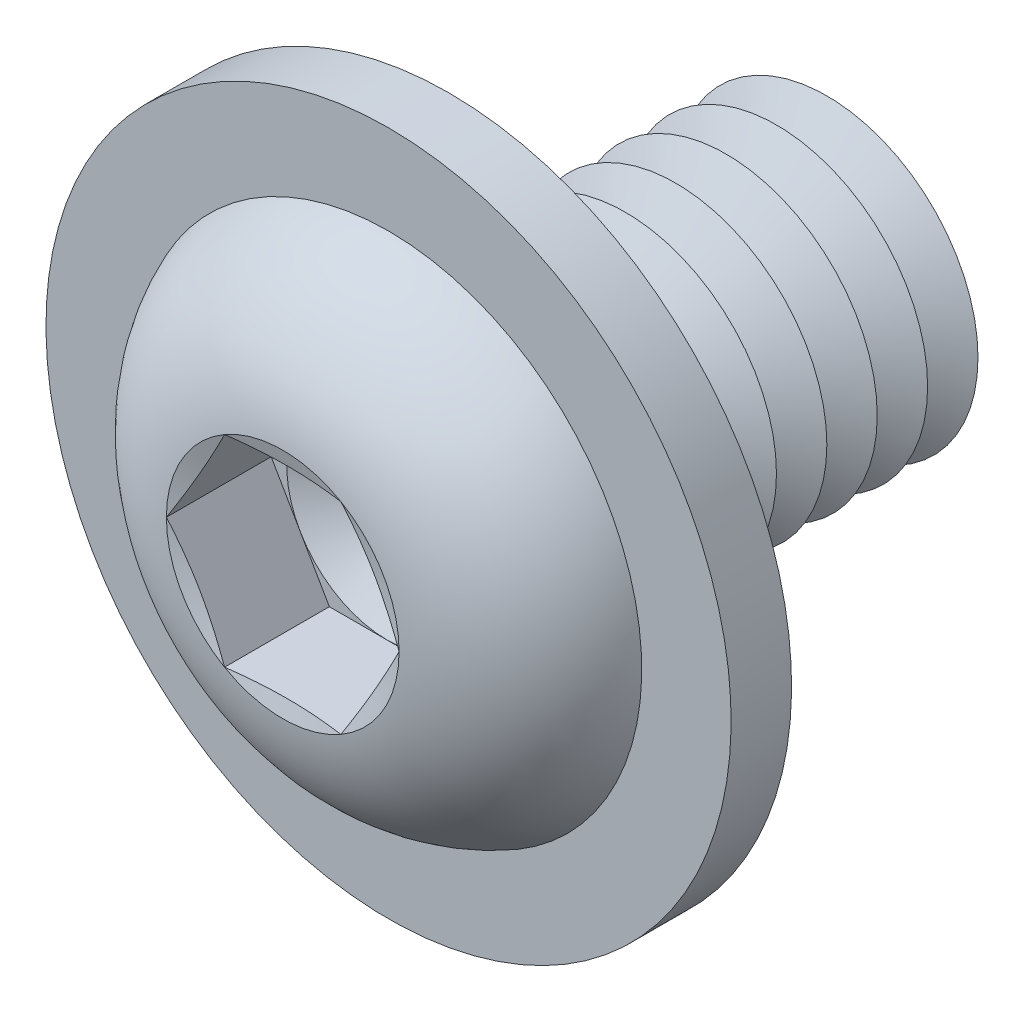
ISO-10303-21;
HEADER;
FILE_DESCRIPTION(('STEP AP214'),'2;1');
FILE_NAME('part.step','',(''),(''),'','','');
FILE_SCHEMA(('AUTOMOTIVE_DESIGN { 1 0 10303 214 1 1 1 1 }'));
ENDSEC;
DATA;
#1=APPLICATION_CONTEXT('core data for automotive mechanical design processes');
#2=APPLICATION_PROTOCOL_DEFINITION('international standard','automotive_design',2000,#1);
#3=PRODUCT_CONTEXT('',#1,'mechanical');
#4=PRODUCT('Part','Part','',(#3));
#5=PRODUCT_RELATED_PRODUCT_CATEGORY('part','',(#4));
#6=PRODUCT_DEFINITION_FORMATION('','',#4);
#7=PRODUCT_DEFINITION_CONTEXT('part definition',#1,'design');
#8=PRODUCT_DEFINITION('design','',#6,#7);
#9=PRODUCT_DEFINITION_SHAPE('','',#8);
#10=(LENGTH_UNIT() NAMED_UNIT(*) SI_UNIT(.MILLI.,.METRE.));
#11=(NAMED_UNIT(*) PLANE_ANGLE_UNIT() SI_UNIT($,.RADIAN.));
#12=(NAMED_UNIT(*) SI_UNIT($,.STERADIAN.) SOLID_ANGLE_UNIT());
#13=UNCERTAINTY_MEASURE_WITH_UNIT(LENGTH_MEASURE(1.E-05),#10,'distance_accuracy_value','');
#14=(GEOMETRIC_REPRESENTATION_CONTEXT(3) GLOBAL_UNCERTAINTY_ASSIGNED_CONTEXT((#13)) GLOBAL_UNIT_ASSIGNED_CONTEXT((#10,
#11,#12)) REPRESENTATION_CONTEXT('',''));
#15=CARTESIAN_POINT('',(0.,0.,0.));
#16=DIRECTION('',(0.,0.,1.));
#17=DIRECTION('',(1.,0.,0.));
#18=AXIS2_PLACEMENT_3D('',#15,#16,#17);
#19=CARTESIAN_POINT('',(0.,0.,-4.5));
#20=DIRECTION('',(0.,0.,1.));
#21=DIRECTION('',(1.,0.,0.));
#22=AXIS2_PLACEMENT_3D('',#19,#20,#21);
#23=CONICAL_SURFACE('',#22,3.,1.0471975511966);
#24=CARTESIAN_POINT('',(0.,0.,-5.));
#25=DIRECTION('',(0.,0.,1.));
#26=DIRECTION('',(1.,0.,0.));
#27=AXIS2_PLACEMENT_3D('',#24,#25,#26);
#28=CIRCLE('',#27,2.13397459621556);
#29=CARTESIAN_POINT('',(2.13397459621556,0.,-5.));
#30=VERTEX_POINT('',#29);
#31=EDGE_CURVE('E274',#30,#30,#28,.T.);
#32=ORIENTED_EDGE('',*,*,#31,.T.);
#33=EDGE_LOOP('',(#32));
#34=FACE_BOUND('',#33,.T.);
#35=CARTESIAN_POINT('',(0.,0.,-4.5));
#36=DIRECTION('',(0.,0.,1.));
#37=DIRECTION('',(1.,0.,0.));
#38=AXIS2_PLACEMENT_3D('',#35,#36,#37);
#39=CIRCLE('',#38,3.);
#40=CARTESIAN_POINT('',(3.,0.,-4.5));
#41=VERTEX_POINT('',#40);
#42=EDGE_CURVE('E270',#41,#41,#39,.T.);
#43=ORIENTED_EDGE('',*,*,#42,.F.);
#44=EDGE_LOOP('',(#43));
#45=FACE_BOUND('',#44,.T.);
#46=ADVANCED_FACE('F39',(#34,#45),#23,.T.);
#47=CARTESIAN_POINT('',(0.,0.,-5.));
#48=DIRECTION('',(0.,0.,-1.));
#49=DIRECTION('',(-1.,0.,0.));
#50=AXIS2_PLACEMENT_3D('',#47,#48,#49);
#51=CONICAL_SURFACE('',#50,2.13397459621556,1.0471975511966);
#52=CARTESIAN_POINT('',(0.,0.,-5.5));
#53=DIRECTION('',(0.,0.,1.));
#54=DIRECTION('',(1.,0.,0.));
#55=AXIS2_PLACEMENT_3D('',#52,#53,#54);
#56=CIRCLE('',#55,3.);
#57=CARTESIAN_POINT('',(3.,0.,-5.5));
#58=VERTEX_POINT('',#57);
#59=EDGE_CURVE('E278',#58,#58,#56,.T.);
#60=ORIENTED_EDGE('',*,*,#59,.T.);
#61=EDGE_LOOP('',(#60));
#62=FACE_BOUND('',#61,.T.);
#63=ORIENTED_EDGE('',*,*,#31,.F.);
#64=EDGE_LOOP('',(#63));
#65=FACE_BOUND('',#64,.T.);
#66=ADVANCED_FACE('F391',(#62,#65),#51,.T.);
#67=CARTESIAN_POINT('',(0.,3.00000000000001,-8.));
#68=DIRECTION('',(0.,0.,-1.));
#69=DIRECTION('',(-1.,0.,0.));
#70=AXIS2_PLACEMENT_3D('',#67,#68,#69);
#71=PLANE('',#70);
#72=CARTESIAN_POINT('',(0.,0.,-8.));
#73=DIRECTION('',(0.,0.,1.));
#74=DIRECTION('',(1.,0.,0.));
#75=AXIS2_PLACEMENT_3D('',#72,#73,#74);
#76=CIRCLE('',#75,2.13397459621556);
#77=CARTESIAN_POINT('',(2.13397459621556,0.,-8.));
#78=VERTEX_POINT('',#77);
#79=EDGE_CURVE('E298',#78,#78,#76,.T.);
#80=ORIENTED_EDGE('',*,*,#79,.F.);
#81=EDGE_LOOP('',(#80));
#82=FACE_BOUND('',#81,.T.);
#83=ADVANCED_FACE('F397',(#82),#71,.T.);
#84=CARTESIAN_POINT('',(0.,0.,-7.5));
#85=DIRECTION('',(0.,0.,1.));
#86=DIRECTION('',(1.,0.,0.));
#87=AXIS2_PLACEMENT_3D('',#84,#85,#86);
#88=CONICAL_SURFACE('',#87,3.,1.0471975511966);
#89=ORIENTED_EDGE('',*,*,#79,.T.);
#90=EDGE_LOOP('',(#89));
#91=FACE_BOUND('',#90,.T.);
#92=CARTESIAN_POINT('',(0.,0.,-7.5));
#93=DIRECTION('',(0.,0.,1.));
#94=DIRECTION('',(1.,0.,0.));
#95=AXIS2_PLACEMENT_3D('',#92,#93,#94);
#96=CIRCLE('',#95,3.);
#97=CARTESIAN_POINT('',(3.,0.,-7.5));
#98=VERTEX_POINT('',#97);
#99=EDGE_CURVE('E294',#98,#98,#96,.T.);
#100=ORIENTED_EDGE('',*,*,#99,.F.);
#101=EDGE_LOOP('',(#100));
#102=FACE_BOUND('',#101,.T.);
#103=ADVANCED_FACE('F416',(#91,#102),#88,.T.);
#104=CARTESIAN_POINT('',(0.,0.,-7.));
#105=DIRECTION('',(0.,0.,-1.));
#106=DIRECTION('',(-1.,0.,0.));
#107=AXIS2_PLACEMENT_3D('',#104,#105,#106);
#108=CONICAL_SURFACE('',#107,2.13397459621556,1.0471975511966);
#109=ORIENTED_EDGE('',*,*,#99,.T.);
#110=EDGE_LOOP('',(#109));
#111=FACE_BOUND('',#110,.T.);
#112=CARTESIAN_POINT('',(0.,0.,-7.));
#113=DIRECTION('',(0.,0.,1.));
#114=DIRECTION('',(1.,0.,0.));
#115=AXIS2_PLACEMENT_3D('',#112,#113,#114);
#116=CIRCLE('',#115,2.13397459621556);
#117=CARTESIAN_POINT('',(2.13397459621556,0.,-7.));
#118=VERTEX_POINT('',#117);
#119=EDGE_CURVE('E290',#118,#118,#116,.T.);
#120=ORIENTED_EDGE('',*,*,#119,.F.);
#121=EDGE_LOOP('',(#120));
#122=FACE_BOUND('',#121,.T.);
#123=ADVANCED_FACE('F413',(#111,#122),#108,.T.);
#124=CARTESIAN_POINT('',(0.,0.,-6.5));
#125=DIRECTION('',(0.,0.,1.));
#126=DIRECTION('',(1.,0.,0.));
#127=AXIS2_PLACEMENT_3D('',#124,#125,#126);
#128=CONICAL_SURFACE('',#127,3.,1.0471975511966);
#129=ORIENTED_EDGE('',*,*,#119,.T.);
#130=EDGE_LOOP('',(#129));
#131=FACE_BOUND('',#130,.T.);
#132=CARTESIAN_POINT('',(0.,0.,-6.5));
#133=DIRECTION('',(0.,0.,1.));
#134=DIRECTION('',(1.,0.,0.));
#135=AXIS2_PLACEMENT_3D('',#132,#133,#134);
#136=CIRCLE('',#135,3.);
#137=CARTESIAN_POINT('',(3.,0.,-6.5));
#138=VERTEX_POINT('',#137);
#139=EDGE_CURVE('E286',#138,#138,#136,.T.);
#140=ORIENTED_EDGE('',*,*,#139,.F.);
#141=EDGE_LOOP('',(#140));
#142=FACE_BOUND('',#141,.T.);
#143=ADVANCED_FACE('F407',(#131,#142),#128,.T.);
#144=CARTESIAN_POINT('',(0.,0.,-6.));
#145=DIRECTION('',(0.,0.,-1.));
#146=DIRECTION('',(-1.,0.,0.));
#147=AXIS2_PLACEMENT_3D('',#144,#145,#146);
#148=CONICAL_SURFACE('',#147,2.13397459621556,1.0471975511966);
#149=ORIENTED_EDGE('',*,*,#139,.T.);
#150=EDGE_LOOP('',(#149));
#151=FACE_BOUND('',#150,.T.);
#152=CARTESIAN_POINT('',(0.,0.,-6.));
#153=DIRECTION('',(0.,0.,1.));
#154=DIRECTION('',(1.,0.,0.));
#155=AXIS2_PLACEMENT_3D('',#152,#153,#154);
#156=CIRCLE('',#155,2.13397459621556);
#157=CARTESIAN_POINT('',(2.13397459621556,0.,-6.));
#158=VERTEX_POINT('',#157);
#159=EDGE_CURVE('E282',#158,#158,#156,.T.);
#160=ORIENTED_EDGE('',*,*,#159,.F.);
#161=EDGE_LOOP('',(#160));
#162=FACE_BOUND('',#161,.T.);
#163=ADVANCED_FACE('F403',(#151,#162),#148,.T.);
#164=CARTESIAN_POINT('',(0.,0.,-5.5));
#165=DIRECTION('',(0.,0.,1.));
#166=DIRECTION('',(1.,0.,0.));
#167=AXIS2_PLACEMENT_3D('',#164,#165,#166);
#168=CONICAL_SURFACE('',#167,3.,1.0471975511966);
#169=ORIENTED_EDGE('',*,*,#159,.T.);
#170=EDGE_LOOP('',(#169));
#171=FACE_BOUND('',#170,.T.);
#172=ORIENTED_EDGE('',*,*,#59,.F.);
#173=EDGE_LOOP('',(#172));
#174=FACE_BOUND('',#173,.T.);
#175=ADVANCED_FACE('F406',(#171,#174),#168,.T.);
#176=CARTESIAN_POINT('',(0.,0.,-3.5));
#177=DIRECTION('',(0.,0.,1.));
#178=DIRECTION('',(1.,0.,0.));
#179=AXIS2_PLACEMENT_3D('',#176,#177,#178);
#180=CONICAL_SURFACE('',#179,3.,1.0471975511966);
#181=CARTESIAN_POINT('',(0.,0.,-4.));
#182=DIRECTION('',(0.,0.,1.));
#183=DIRECTION('',(1.,0.,0.));
#184=AXIS2_PLACEMENT_3D('',#181,#182,#183);
#185=CIRCLE('',#184,2.13397459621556);
#186=CARTESIAN_POINT('',(2.13397459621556,0.,-4.));
#187=VERTEX_POINT('',#186);
#188=EDGE_CURVE('E266',#187,#187,#185,.T.);
#189=ORIENTED_EDGE('',*,*,#188,.T.);
#190=EDGE_LOOP('',(#189));
#191=FACE_BOUND('',#190,.T.);
#192=CARTESIAN_POINT('',(0.,0.,-3.5));
#193=DIRECTION('',(0.,0.,1.));
#194=DIRECTION('',(1.,0.,0.));
#195=AXIS2_PLACEMENT_3D('',#192,#193,#194);
#196=CIRCLE('',#195,3.);
#197=CARTESIAN_POINT('',(3.,0.,-3.5));
#198=VERTEX_POINT('',#197);
#199=EDGE_CURVE('E262',#198,#198,#196,.T.);
#200=ORIENTED_EDGE('',*,*,#199,.F.);
#201=EDGE_LOOP('',(#200));
#202=FACE_BOUND('',#201,.T.);
#203=ADVANCED_FACE('F411',(#191,#202),#180,.T.);
#204=CARTESIAN_POINT('',(0.,0.,-4.));
#205=DIRECTION('',(0.,0.,-1.));
#206=DIRECTION('',(-1.,0.,0.));
#207=AXIS2_PLACEMENT_3D('',#204,#205,#206);
#208=CONICAL_SURFACE('',#207,2.13397459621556,1.0471975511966);
#209=ORIENTED_EDGE('',*,*,#42,.T.);
#210=EDGE_LOOP('',(#209));
#211=FACE_BOUND('',#210,.T.);
#212=ORIENTED_EDGE('',*,*,#188,.F.);
#213=EDGE_LOOP('',(#212));
#214=FACE_BOUND('',#213,.T.);
#215=ADVANCED_FACE('F462',(#211,#214),#208,.T.);
#216=CARTESIAN_POINT('',(0.,0.,-2.5));
#217=DIRECTION('',(0.,0.,1.));
#218=DIRECTION('',(1.,0.,0.));
#219=AXIS2_PLACEMENT_3D('',#216,#217,#218);
#220=CONICAL_SURFACE('',#219,3.,1.0471975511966);
#221=CARTESIAN_POINT('',(0.,0.,-3.));
#222=DIRECTION('',(0.,0.,1.));
#223=DIRECTION('',(1.,0.,0.));
#224=AXIS2_PLACEMENT_3D('',#221,#222,#223);
#225=CIRCLE('',#224,2.13397459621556);
#226=CARTESIAN_POINT('',(2.13397459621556,0.,-3.));
#227=VERTEX_POINT('',#226);
#228=EDGE_CURVE('E258',#227,#227,#225,.T.);
#229=ORIENTED_EDGE('',*,*,#228,.T.);
#230=EDGE_LOOP('',(#229));
#231=FACE_BOUND('',#230,.T.);
#232=CARTESIAN_POINT('',(0.,0.,-2.5));
#233=DIRECTION('',(0.,0.,1.));
#234=DIRECTION('',(1.,0.,0.));
#235=AXIS2_PLACEMENT_3D('',#232,#233,#234);
#236=CIRCLE('',#235,3.);
#237=CARTESIAN_POINT('',(3.,0.,-2.5));
#238=VERTEX_POINT('',#237);
#239=EDGE_CURVE('E254',#238,#238,#236,.T.);
#240=ORIENTED_EDGE('',*,*,#239,.F.);
#241=EDGE_LOOP('',(#240));
#242=FACE_BOUND('',#241,.T.);
#243=ADVANCED_FACE('F468',(#231,#242),#220,.T.);
#244=CARTESIAN_POINT('',(0.,0.,-3.));
#245=DIRECTION('',(0.,0.,-1.));
#246=DIRECTION('',(-1.,0.,0.));
#247=AXIS2_PLACEMENT_3D('',#244,#245,#246);
#248=CONICAL_SURFACE('',#247,2.13397459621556,1.0471975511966);
#249=ORIENTED_EDGE('',*,*,#199,.T.);
#250=EDGE_LOOP('',(#249));
#251=FACE_BOUND('',#250,.T.);
#252=ORIENTED_EDGE('',*,*,#228,.F.);
#253=EDGE_LOOP('',(#252));
#254=FACE_BOUND('',#253,.T.);
#255=ADVANCED_FACE('F475',(#251,#254),#248,.T.);
#256=CARTESIAN_POINT('',(0.,0.,-1.5));
#257=DIRECTION('',(0.,0.,1.));
#258=DIRECTION('',(1.,0.,0.));
#259=AXIS2_PLACEMENT_3D('',#256,#257,#258);
#260=CONICAL_SURFACE('',#259,3.,1.0471975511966);
#261=CARTESIAN_POINT('',(0.,0.,-2.));
#262=DIRECTION('',(0.,0.,1.));
#263=DIRECTION('',(1.,0.,0.));
#264=AXIS2_PLACEMENT_3D('',#261,#262,#263);
#265=CIRCLE('',#264,2.13397459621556);
#266=CARTESIAN_POINT('',(2.13397459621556,0.,-2.));
#267=VERTEX_POINT('',#266);
#268=EDGE_CURVE('E250',#267,#267,#265,.T.);
#269=ORIENTED_EDGE('',*,*,#268,.T.);
#270=EDGE_LOOP('',(#269));
#271=FACE_BOUND('',#270,.T.);
#272=CARTESIAN_POINT('',(0.,0.,-1.5));
#273=DIRECTION('',(0.,0.,1.));
#274=DIRECTION('',(1.,0.,0.));
#275=AXIS2_PLACEMENT_3D('',#272,#273,#274);
#276=CIRCLE('',#275,3.);
#277=CARTESIAN_POINT('',(3.,0.,-1.5));
#278=VERTEX_POINT('',#277);
#279=EDGE_CURVE('E242',#278,#278,#276,.T.);
#280=ORIENTED_EDGE('',*,*,#279,.F.);
#281=EDGE_LOOP('',(#280));
#282=FACE_BOUND('',#281,.T.);
#283=ADVANCED_FACE('F482',(#271,#282),#260,.T.);
#284=CARTESIAN_POINT('',(0.,0.,-2.));
#285=DIRECTION('',(0.,0.,-1.));
#286=DIRECTION('',(-1.,0.,0.));
#287=AXIS2_PLACEMENT_3D('',#284,#285,#286);
#288=CONICAL_SURFACE('',#287,2.13397459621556,1.0471975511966);
#289=ORIENTED_EDGE('',*,*,#239,.T.);
#290=EDGE_LOOP('',(#289));
#291=FACE_BOUND('',#290,.T.);
#292=ORIENTED_EDGE('',*,*,#268,.F.);
#293=EDGE_LOOP('',(#292));
#294=FACE_BOUND('',#293,.T.);
#295=ADVANCED_FACE('F489',(#291,#294),#288,.T.);
#296=CARTESIAN_POINT('',(0.,0.,-0.499999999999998));
#297=DIRECTION('',(0.,0.,1.));
#298=DIRECTION('',(1.,0.,0.));
#299=AXIS2_PLACEMENT_3D('',#296,#297,#298);
#300=CONICAL_SURFACE('',#299,3.,1.0471975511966);
#301=CARTESIAN_POINT('',(0.,0.,-0.999999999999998));
#302=DIRECTION('',(0.,0.,1.));
#303=DIRECTION('',(1.,0.,0.));
#304=AXIS2_PLACEMENT_3D('',#301,#302,#303);
#305=CIRCLE('',#304,2.13397459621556);
#306=CARTESIAN_POINT('',(2.13397459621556,0.,-0.999999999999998));
#307=VERTEX_POINT('',#306);
#308=EDGE_CURVE('E231',#307,#307,#305,.T.);
#309=ORIENTED_EDGE('',*,*,#308,.T.);
#310=EDGE_LOOP('',(#309));
#311=FACE_BOUND('',#310,.T.);
#312=CARTESIAN_POINT('',(0.,0.,-0.499999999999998));
#313=DIRECTION('',(0.,0.,1.));
#314=DIRECTION('',(1.,0.,0.));
#315=AXIS2_PLACEMENT_3D('',#312,#313,#314);
#316=CIRCLE('',#315,3.);
#317=CARTESIAN_POINT('',(3.,0.,-0.499999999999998));
#318=VERTEX_POINT('',#317);
#319=EDGE_CURVE('E246',#318,#318,#316,.T.);
#320=ORIENTED_EDGE('',*,*,#319,.F.);
#321=EDGE_LOOP('',(#320));
#322=FACE_BOUND('',#321,.T.);
#323=ADVANCED_FACE('F496',(#311,#322),#300,.T.);
#324=CARTESIAN_POINT('',(0.,0.,-0.999999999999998));
#325=DIRECTION('',(0.,0.,-1.));
#326=DIRECTION('',(-1.,0.,0.));
#327=AXIS2_PLACEMENT_3D('',#324,#325,#326);
#328=CONICAL_SURFACE('',#327,2.13397459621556,1.0471975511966);
#329=ORIENTED_EDGE('',*,*,#279,.T.);
#330=EDGE_LOOP('',(#329));
#331=FACE_BOUND('',#330,.T.);
#332=ORIENTED_EDGE('',*,*,#308,.F.);
#333=EDGE_LOOP('',(#332));
#334=FACE_BOUND('',#333,.T.);
#335=ADVANCED_FACE('F220',(#331,#334),#328,.T.);
#336=CARTESIAN_POINT('',(0.,3.,0.));
#337=DIRECTION('',(0.,0.,-1.));
#338=DIRECTION('',(-1.,0.,0.));
#339=AXIS2_PLACEMENT_3D('',#336,#337,#338);
#340=PLANE('',#339);
#341=CARTESIAN_POINT('',(0.,0.,0.));
#342=DIRECTION('',(0.,0.,-1.));
#343=DIRECTION('',(-1.,0.,0.));
#344=AXIS2_PLACEMENT_3D('',#341,#342,#343);
#345=CIRCLE('',#344,3.5);
#346=CARTESIAN_POINT('',(-3.5,0.,0.));
#347=VERTEX_POINT('',#346);
#348=EDGE_CURVE('E307',#347,#347,#345,.F.);
#349=ORIENTED_EDGE('',*,*,#348,.T.);
#350=EDGE_LOOP('',(#349));
#351=FACE_BOUND('',#350,.T.);
#352=CARTESIAN_POINT('',(0.,0.,0.));
#353=DIRECTION('',(0.,0.,-1.));
#354=DIRECTION('',(0.,1.,0.));
#355=AXIS2_PLACEMENT_3D('',#352,#353,#354);
#356=CIRCLE('',#355,6.8);
#357=CARTESIAN_POINT('',(0.,6.8,0.));
#358=VERTEX_POINT('',#357);
#359=EDGE_CURVE('E794',#358,#358,#356,.T.);
#360=ORIENTED_EDGE('',*,*,#359,.T.);
#361=EDGE_LOOP('',(#360));
#362=FACE_BOUND('',#361,.T.);
#363=ADVANCED_FACE('F508',(#351,#362),#340,.T.);
#364=CARTESIAN_POINT('',(0.,0.,-0.5));
#365=DIRECTION('',(0.,0.,-1.));
#366=DIRECTION('',(-1.,0.,0.));
#367=AXIS2_PLACEMENT_3D('',#364,#365,#366);
#368=TOROIDAL_SURFACE('',#367,3.5,0.5);
#369=ORIENTED_EDGE('',*,*,#348,.F.);
#370=EDGE_LOOP('',(#369));
#371=FACE_BOUND('',#370,.T.);
#372=ORIENTED_EDGE('',*,*,#319,.T.);
#373=EDGE_LOOP('',(#372));
#374=FACE_BOUND('',#373,.T.);
#375=ADVANCED_FACE('F41',(#371,#374),#368,.F.);
#376=CARTESIAN_POINT('',(0.,0.,1.2));
#377=DIRECTION('',(0.,0.,-1.));
#378=DIRECTION('',(0.,1.,0.));
#379=AXIS2_PLACEMENT_3D('',#376,#377,#378);
#380=CYLINDRICAL_SURFACE('',#379,6.8);
#381=CARTESIAN_POINT('',(0.,0.,1.2));
#382=DIRECTION('',(0.,0.,-1.));
#383=DIRECTION('',(0.,1.,0.));
#384=AXIS2_PLACEMENT_3D('',#381,#382,#383);
#385=CIRCLE('',#384,6.8);
#386=CARTESIAN_POINT('',(0.,6.8,1.2));
#387=VERTEX_POINT('',#386);
#388=EDGE_CURVE('E790',#387,#387,#385,.T.);
#389=ORIENTED_EDGE('',*,*,#388,.T.);
#390=EDGE_LOOP('',(#389));
#391=FACE_BOUND('',#390,.T.);
#392=ORIENTED_EDGE('',*,*,#359,.F.);
#393=EDGE_LOOP('',(#392));
#394=FACE_BOUND('',#393,.T.);
#395=ADVANCED_FACE('F519',(#391,#394),#380,.T.);
#396=CARTESIAN_POINT('',(0.,0.,1.2));
#397=DIRECTION('',(0.,0.,-1.));
#398=DIRECTION('',(0.,1.,0.));
#399=AXIS2_PLACEMENT_3D('',#396,#397,#398);
#400=PLANE('',#399);
#401=CARTESIAN_POINT('',(0.,0.,1.2));
#402=DIRECTION('',(0.,0.,-1.));
#403=DIRECTION('',(0.,1.,0.));
#404=AXIS2_PLACEMENT_3D('',#401,#402,#403);
#405=CIRCLE('',#404,5.02568742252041);
#406=CARTESIAN_POINT('',(0.,5.02568742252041,1.2));
#407=VERTEX_POINT('',#406);
#408=EDGE_CURVE('E43',#407,#407,#405,.F.);
#409=ORIENTED_EDGE('',*,*,#408,.F.);
#410=EDGE_LOOP('',(#409));
#411=FACE_BOUND('',#410,.T.);
#412=ORIENTED_EDGE('',*,*,#388,.F.);
#413=EDGE_LOOP('',(#412));
#414=FACE_BOUND('',#413,.T.);
#415=ADVANCED_FACE('F117',(#411,#414),#400,.F.);
#416=CARTESIAN_POINT('',(0.,0.,1.22));
#417=DIRECTION('',(0.,0.,1.));
#418=DIRECTION('',(1.,0.,0.));
#419=AXIS2_PLACEMENT_3D('',#416,#417,#418);
#420=CONICAL_SURFACE('',#419,1.99999906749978,1.0471975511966);
#421=CARTESIAN_POINT('',(0.,0.,0.0653000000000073));
#422=VERTEX_POINT('',#421);
#423=VERTEX_LOOP('',#422);
#424=FACE_BOUND('',#423,.T.);
#425=CARTESIAN_POINT('',(0.,0.,1.22));
#426=DIRECTION('',(0.,0.,1.));
#427=DIRECTION('',(1.,0.,0.));
#428=AXIS2_PLACEMENT_3D('',#425,#426,#427);
#429=CIRCLE('',#428,1.99999906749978);
#430=CARTESIAN_POINT('',(1.73205,0.999999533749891,1.22));
#431=VERTEX_POINT('',#430);
#432=CARTESIAN_POINT('',(0.,1.99999906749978,1.22));
#433=VERTEX_POINT('',#432);
#434=EDGE_CURVE('E120',#431,#433,#429,.T.);
#435=ORIENTED_EDGE('',*,*,#434,.T.);
#436=CARTESIAN_POINT('',(0.,0.,1.22));
#437=DIRECTION('',(0.,0.,1.));
#438=DIRECTION('',(1.,0.,0.));
#439=AXIS2_PLACEMENT_3D('',#436,#437,#438);
#440=CIRCLE('',#439,1.99999906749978);
#441=CARTESIAN_POINT('',(-1.73205,0.999999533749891,1.22));
#442=VERTEX_POINT('',#441);
#443=EDGE_CURVE('E11',#433,#442,#440,.T.);
#444=ORIENTED_EDGE('',*,*,#443,.T.);
#445=CARTESIAN_POINT('',(-1.73205,-0.999999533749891,1.22));
#446=VERTEX_POINT('',#445);
#447=EDGE_CURVE('E49',#442,#446,#440,.T.);
#448=ORIENTED_EDGE('',*,*,#447,.T.);
#449=CARTESIAN_POINT('',(0.,-1.99999906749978,1.22));
#450=VERTEX_POINT('',#449);
#451=EDGE_CURVE('E313',#446,#450,#440,.T.);
#452=ORIENTED_EDGE('',*,*,#451,.T.);
#453=CARTESIAN_POINT('',(1.73205,-0.999999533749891,1.22));
#454=VERTEX_POINT('',#453);
#455=EDGE_CURVE('E57',#450,#454,#440,.T.);
#456=ORIENTED_EDGE('',*,*,#455,.T.);
#457=EDGE_CURVE('E50',#454,#431,#440,.T.);
#458=ORIENTED_EDGE('',*,*,#457,.T.);
#459=EDGE_LOOP('',(#435,#444,#448,#452,#456,#458));
#460=FACE_BOUND('',#459,.T.);
#461=ADVANCED_FACE('F114',(#424,#460),#420,.F.);
#462=CARTESIAN_POINT('',(0.,0.,1.22));
#463=DIRECTION('',(0.,0.,1.));
#464=DIRECTION('',(1.,0.,0.));
#465=AXIS2_PLACEMENT_3D('',#462,#463,#464);
#466=PLANE('',#465);
#467=ORIENTED_EDGE('',*,*,#451,.F.);
#468=DIRECTION('',(0.5,-0.866025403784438,0.));
#469=VECTOR('',#468,1.);
#470=CARTESIAN_POINT('',(-2.3094,0.,1.22));
#471=LINE('',#470,#469);
#472=CARTESIAN_POINT('',(-1.1547,-1.99999906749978,1.22));
#473=VERTEX_POINT('',#472);
#474=EDGE_CURVE('E154',#446,#473,#471,.T.);
#475=ORIENTED_EDGE('',*,*,#474,.T.);
#476=DIRECTION('',(1.,0.,0.));
#477=VECTOR('',#476,1.);
#478=CARTESIAN_POINT('',(-1.1547,-1.99999906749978,1.22));
#479=LINE('',#478,#477);
#480=EDGE_CURVE('E160',#473,#450,#479,.T.);
#481=ORIENTED_EDGE('',*,*,#480,.T.);
#482=EDGE_LOOP('',(#467,#475,#481));
#483=FACE_BOUND('',#482,.T.);
#484=ADVANCED_FACE('F116',(#483),#466,.T.);
#485=ORIENTED_EDGE('',*,*,#455,.F.);
#486=CARTESIAN_POINT('',(1.1547,-1.99999906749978,1.22));
#487=VERTEX_POINT('',#486);
#488=EDGE_CURVE('E159',#450,#487,#479,.T.);
#489=ORIENTED_EDGE('',*,*,#488,.T.);
#490=DIRECTION('',(0.5,0.866025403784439,0.));
#491=VECTOR('',#490,1.);
#492=CARTESIAN_POINT('',(1.1547,-1.99999906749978,1.22));
#493=LINE('',#492,#491);
#494=EDGE_CURVE('E164',#487,#454,#493,.T.);
#495=ORIENTED_EDGE('',*,*,#494,.T.);
#496=EDGE_LOOP('',(#485,#489,#495));
#497=FACE_BOUND('',#496,.T.);
#498=ADVANCED_FACE('F540',(#497),#466,.T.);
#499=ORIENTED_EDGE('',*,*,#457,.F.);
#500=CARTESIAN_POINT('',(2.3094,0.,1.22));
#501=VERTEX_POINT('',#500);
#502=EDGE_CURVE('E163',#454,#501,#493,.T.);
#503=ORIENTED_EDGE('',*,*,#502,.T.);
#504=DIRECTION('',(-0.5,0.866025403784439,0.));
#505=VECTOR('',#504,1.);
#506=CARTESIAN_POINT('',(2.3094,0.,1.22));
#507=LINE('',#506,#505);
#508=EDGE_CURVE('E142',#501,#431,#507,.T.);
#509=ORIENTED_EDGE('',*,*,#508,.T.);
#510=EDGE_LOOP('',(#499,#503,#509));
#511=FACE_BOUND('',#510,.T.);
#512=ADVANCED_FACE('F545',(#511),#466,.T.);
#513=ORIENTED_EDGE('',*,*,#434,.F.);
#514=CARTESIAN_POINT('',(1.1547,1.99999906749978,1.22));
#515=VERTEX_POINT('',#514);
#516=EDGE_CURVE('E127',#431,#515,#507,.T.);
#517=ORIENTED_EDGE('',*,*,#516,.T.);
#518=DIRECTION('',(-1.,0.,0.));
#519=VECTOR('',#518,1.);
#520=CARTESIAN_POINT('',(1.1547,1.99999906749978,1.22));
#521=LINE('',#520,#519);
#522=EDGE_CURVE('E138',#515,#433,#521,.T.);
#523=ORIENTED_EDGE('',*,*,#522,.T.);
#524=EDGE_LOOP('',(#513,#517,#523));
#525=FACE_BOUND('',#524,.T.);
#526=ADVANCED_FACE('F144',(#525),#466,.T.);
#527=ORIENTED_EDGE('',*,*,#443,.F.);
#528=CARTESIAN_POINT('',(-1.1547,1.99999906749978,1.22));
#529=VERTEX_POINT('',#528);
#530=EDGE_CURVE('E133',#433,#529,#521,.T.);
#531=ORIENTED_EDGE('',*,*,#530,.T.);
#532=DIRECTION('',(-0.5,-0.866025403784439,0.));
#533=VECTOR('',#532,1.);
#534=CARTESIAN_POINT('',(-1.1547,1.99999906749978,1.22));
#535=LINE('',#534,#533);
#536=EDGE_CURVE('E136',#529,#442,#535,.T.);
#537=ORIENTED_EDGE('',*,*,#536,.T.);
#538=EDGE_LOOP('',(#527,#531,#537));
#539=FACE_BOUND('',#538,.T.);
#540=ADVANCED_FACE('F132',(#539),#466,.T.);
#541=ORIENTED_EDGE('',*,*,#447,.F.);
#542=CARTESIAN_POINT('',(-2.3094,0.,1.22));
#543=VERTEX_POINT('',#542);
#544=EDGE_CURVE('E146',#442,#543,#535,.T.);
#545=ORIENTED_EDGE('',*,*,#544,.T.);
#546=EDGE_CURVE('E155',#543,#446,#471,.T.);
#547=ORIENTED_EDGE('',*,*,#546,.T.);
#548=EDGE_LOOP('',(#541,#545,#547));
#549=FACE_BOUND('',#548,.T.);
#550=ADVANCED_FACE('F330',(#549),#466,.T.);
#551=CARTESIAN_POINT('',(-2.3094,0.,1.22));
#552=DIRECTION('',(-0.866025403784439,-0.5,0.));
#553=DIRECTION('',(0.5,-0.866025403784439,0.));
#554=AXIS2_PLACEMENT_3D('',#551,#552,#553);
#555=PLANE('',#554);
#556=CARTESIAN_POINT('',(-2.30951547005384,0.000200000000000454,3.30003094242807));
#557=CARTESIAN_POINT('',(-2.26155412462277,-0.082871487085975,3.2871729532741));
#558=CARTESIAN_POINT('',(-2.21350580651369,-0.166093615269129,3.27549992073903));
#559=CARTESIAN_POINT('',(-2.11723944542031,-0.332831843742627,3.2549913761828));
#560=CARTESIAN_POINT('',(-2.06902134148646,-0.416348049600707,3.24615701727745));
#561=CARTESIAN_POINT('',(-1.97270782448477,-0.583167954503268,3.23184167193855));
#562=CARTESIAN_POINT('',(-1.92461306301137,-0.666470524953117,3.22634360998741));
#563=CARTESIAN_POINT('',(-1.82836219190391,-0.83318192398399,3.21897125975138));
#564=CARTESIAN_POINT('',(-1.78020609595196,-0.916590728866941,3.21709626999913));
#565=CARTESIAN_POINT('',(-1.68389390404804,-1.08340833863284,3.21709626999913));
#566=CARTESIAN_POINT('',(-1.63573780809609,-1.16681714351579,3.21897125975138));
#567=CARTESIAN_POINT('',(-1.53948693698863,-1.33352854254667,3.22634360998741));
#568=CARTESIAN_POINT('',(-1.49139217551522,-1.41683111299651,3.23184167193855));
#569=CARTESIAN_POINT('',(-1.39507865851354,-1.58365101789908,3.24615701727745));
#570=CARTESIAN_POINT('',(-1.34686055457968,-1.66716722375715,3.2549913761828));
#571=CARTESIAN_POINT('',(-1.25059419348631,-1.83390545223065,3.27549992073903));
#572=CARTESIAN_POINT('',(-1.20254587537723,-1.91712758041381,3.2871729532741));
#573=CARTESIAN_POINT('',(-1.15458452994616,-2.00019906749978,3.30003094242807));
#574=B_SPLINE_CURVE_WITH_KNOTS('',3,(#556,#557,#558,#559,#560,#561,#562,#563,#564,#565,#566,
#567,#568,#569,#570,#571,#572,#573),.UNSPECIFIED.,.F.,.F.,(4,2,2,2,2,2,2,2,4),(0.,
0.290357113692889,0.580832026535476,0.869807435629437,1.15872689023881,1.44764634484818,
1.73662175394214,2.02709666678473,2.31745378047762),.UNSPECIFIED.);
#575=CARTESIAN_POINT('',(-2.3094,0.,3.3));
#576=VERTEX_POINT('',#575);
#577=CARTESIAN_POINT('',(-1.1547,-1.99999906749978,3.3));
#578=VERTEX_POINT('',#577);
#579=EDGE_CURVE('E335',#576,#578,#574,.T.);
#580=ORIENTED_EDGE('',*,*,#579,.T.);
#581=DIRECTION('',(0.,0.,1.));
#582=VECTOR('',#581,1.);
#583=CARTESIAN_POINT('',(-1.1547,-1.99999906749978,1.22));
#584=LINE('',#583,#582);
#585=EDGE_CURVE('E177',#473,#578,#584,.T.);
#586=ORIENTED_EDGE('',*,*,#585,.F.);
#587=ORIENTED_EDGE('',*,*,#474,.F.);
#588=ORIENTED_EDGE('',*,*,#546,.F.);
#589=DIRECTION('',(0.,0.,1.));
#590=VECTOR('',#589,1.);
#591=CARTESIAN_POINT('',(-2.3094,0.,1.22));
#592=LINE('',#591,#590);
#593=EDGE_CURVE('E181',#543,#576,#592,.T.);
#594=ORIENTED_EDGE('',*,*,#593,.T.);
#595=EDGE_LOOP('',(#580,#586,#587,#588,#594));
#596=FACE_BOUND('',#595,.T.);
#597=ADVANCED_FACE('F328',(#596),#555,.F.);
#598=CARTESIAN_POINT('',(-1.1547,-1.99999906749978,1.22));
#599=DIRECTION('',(0.,-1.,0.));
#600=DIRECTION('',(0.,0.,-1.));
#601=AXIS2_PLACEMENT_3D('',#598,#599,#600);
#602=PLANE('',#601);
#603=CARTESIAN_POINT('',(-3.4849337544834,-1.99999906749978,3.75783251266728));
#604=CARTESIAN_POINT('',(-3.40057136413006,-1.99999906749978,3.7382285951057));
#605=CARTESIAN_POINT('',(-3.31617090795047,-1.99999906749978,3.71878852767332));
#606=CARTESIAN_POINT('',(-3.14727791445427,-1.99999906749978,3.68030638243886));
#607=CARTESIAN_POINT('',(-3.06278537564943,-1.99999906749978,3.6612643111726));
#608=CARTESIAN_POINT('',(-2.80911712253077,-1.99999906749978,3.604834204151));
#609=CARTESIAN_POINT('',(-2.63978343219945,-1.99999906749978,3.5681499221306));
#610=CARTESIAN_POINT('',(-2.29895421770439,-1.99999906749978,3.49717072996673));
#611=CARTESIAN_POINT('',(-2.12745330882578,-1.99999906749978,3.4629014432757));
#612=CARTESIAN_POINT('',(-1.78364663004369,-1.99999906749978,3.39849485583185));
#613=CARTESIAN_POINT('',(-1.61134079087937,-1.99999906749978,3.36835791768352));
#614=CARTESIAN_POINT('',(-1.27040784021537,-1.99999906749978,3.31501553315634));
#615=CARTESIAN_POINT('',(-1.10180724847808,-1.99999906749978,3.29164468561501));
#616=CARTESIAN_POINT('',(-0.76364137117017,-1.99999906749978,3.2533727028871));
#617=CARTESIAN_POINT('',(-0.594076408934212,-1.99999906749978,3.23846888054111));
#618=CARTESIAN_POINT('',(-0.339649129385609,-1.99999906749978,3.22431372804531));
#619=CARTESIAN_POINT('',(-0.255009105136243,-1.99999906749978,3.22096057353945));
#620=CARTESIAN_POINT('',(-0.0856618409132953,-1.99999906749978,3.21711210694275));
#621=CARTESIAN_POINT('',(-0.000954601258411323,-1.99999906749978,3.21661678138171));
#622=CARTESIAN_POINT('',(0.168430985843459,-1.99999906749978,3.21851478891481));
#623=CARTESIAN_POINT('',(0.253109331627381,-1.99999906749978,3.22090826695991));
#624=CARTESIAN_POINT('',(0.422344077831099,-1.99999906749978,3.22845792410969));
#625=CARTESIAN_POINT('',(0.506900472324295,-1.99999906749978,3.23361423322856));
#626=CARTESIAN_POINT('',(0.712240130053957,-1.99999906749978,3.24921577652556));
#627=CARTESIAN_POINT('',(0.832922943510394,-1.99999906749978,3.26098285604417));
#628=CARTESIAN_POINT('',(1.07378161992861,-1.99999906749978,3.28874908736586));
#629=CARTESIAN_POINT('',(1.1939575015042,-1.99999906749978,3.30474808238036));
#630=CARTESIAN_POINT('',(1.43419655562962,-1.99999906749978,3.34009172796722));
#631=CARTESIAN_POINT('',(1.55425817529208,-1.99999906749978,3.35944677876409));
#632=CARTESIAN_POINT('',(1.79394991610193,-1.99999906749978,3.40067076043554));
#633=CARTESIAN_POINT('',(1.91358001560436,-1.99999906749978,3.42253981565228));
#634=CARTESIAN_POINT('',(2.15493405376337,-1.99999906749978,3.46864194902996));
#635=CARTESIAN_POINT('',(2.27665041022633,-1.99999906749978,3.49291441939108));
#636=CARTESIAN_POINT('',(2.51977680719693,-1.99999906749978,3.54294628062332));
#637=CARTESIAN_POINT('',(2.64118684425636,-1.99999906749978,3.56870568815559));
#638=CARTESIAN_POINT('',(2.88310060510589,-1.99999906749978,3.6212089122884));
#639=CARTESIAN_POINT('',(3.00360566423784,-1.99999906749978,3.64794660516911));
#640=CARTESIAN_POINT('',(3.24441021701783,-1.99999906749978,3.70229477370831));
#641=CARTESIAN_POINT('',(3.36470972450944,-1.99999906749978,3.7299051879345));
#642=CARTESIAN_POINT('',(3.4849337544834,-1.99999906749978,3.75783251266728));
#643=B_SPLINE_CURVE_WITH_KNOTS('',3,(#603,#604,#605,#606,#607,#608,#609,#610,#611,#612,#613,
#614,#615,#616,#617,#618,#619,#620,#621,#622,#623,#624,#625,#626,#627,#628,#629,#630,#631,#632,
#633,#634,#635,#636,#637,#638,#639,#640,#641,#642),.UNSPECIFIED.,.F.,.F.,(4,2,2,2,2,2,2,2,2,2,2,
2,2,2,2,2,2,2,2,4),(0.,0.259830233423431,0.519664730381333,1.03943435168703,1.56407662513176,
2.08876490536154,2.59926476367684,3.10960251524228,3.36367930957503,3.61775490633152,
3.87184325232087,4.1259435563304,4.48960924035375,4.85326145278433,5.21806142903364,
5.58287945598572,5.95520617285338,6.32753706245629,6.69784064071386,7.06811821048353),.UNSPECIFIED.);
#644=CARTESIAN_POINT('',(1.1547,-1.99999906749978,3.3));
#645=VERTEX_POINT('',#644);
#646=EDGE_CURVE('E341',#578,#645,#643,.T.);
#647=ORIENTED_EDGE('',*,*,#646,.T.);
#648=DIRECTION('',(0.,0.,1.));
#649=VECTOR('',#648,1.);
#650=CARTESIAN_POINT('',(1.1547,-1.99999906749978,1.22));
#651=LINE('',#650,#649);
#652=EDGE_CURVE('E173',#487,#645,#651,.T.);
#653=ORIENTED_EDGE('',*,*,#652,.F.);
#654=ORIENTED_EDGE('',*,*,#488,.F.);
#655=ORIENTED_EDGE('',*,*,#480,.F.);
#656=ORIENTED_EDGE('',*,*,#585,.T.);
#657=EDGE_LOOP('',(#647,#653,#654,#655,#656));
#658=FACE_BOUND('',#657,.T.);
#659=ADVANCED_FACE('F380',(#658),#602,.F.);
#660=CARTESIAN_POINT('',(1.1547,-1.99999906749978,1.22));
#661=DIRECTION('',(0.866025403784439,-0.5,0.));
#662=DIRECTION('',(0.5,0.866025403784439,0.));
#663=AXIS2_PLACEMENT_3D('',#660,#661,#662);
#664=PLANE('',#663);
#665=CARTESIAN_POINT('',(1.15458452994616,-2.00019906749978,3.30003094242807));
#666=CARTESIAN_POINT('',(1.20254587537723,-1.91712758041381,3.2871729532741));
#667=CARTESIAN_POINT('',(1.25059419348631,-1.83390545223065,3.27549992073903));
#668=CARTESIAN_POINT('',(1.34686055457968,-1.66716722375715,3.2549913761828));
#669=CARTESIAN_POINT('',(1.39507865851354,-1.58365101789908,3.24615701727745));
#670=CARTESIAN_POINT('',(1.49139217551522,-1.41683111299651,3.23184167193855));
#671=CARTESIAN_POINT('',(1.53948693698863,-1.33352854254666,3.22634360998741));
#672=CARTESIAN_POINT('',(1.63573780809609,-1.16681714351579,3.21897125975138));
#673=CARTESIAN_POINT('',(1.68389390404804,-1.08340833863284,3.21709626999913));
#674=CARTESIAN_POINT('',(1.78020609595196,-0.91659072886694,3.21709626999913));
#675=CARTESIAN_POINT('',(1.82836219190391,-0.83318192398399,3.21897125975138));
#676=CARTESIAN_POINT('',(1.92461306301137,-0.666470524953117,3.22634360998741));
#677=CARTESIAN_POINT('',(1.97270782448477,-0.583167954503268,3.23184167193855));
#678=CARTESIAN_POINT('',(2.06902134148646,-0.416348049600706,3.24615701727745));
#679=CARTESIAN_POINT('',(2.11723944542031,-0.332831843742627,3.2549913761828));
#680=CARTESIAN_POINT('',(2.21350580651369,-0.166093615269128,3.27549992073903));
#681=CARTESIAN_POINT('',(2.26155412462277,-0.0828714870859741,3.2871729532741));
#682=CARTESIAN_POINT('',(2.30951547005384,0.000200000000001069,3.30003094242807));
#683=B_SPLINE_CURVE_WITH_KNOTS('',3,(#665,#666,#667,#668,#669,#670,#671,#672,#673,#674,#675,
#676,#677,#678,#679,#680,#681,#682),.UNSPECIFIED.,.F.,.F.,(4,2,2,2,2,2,2,2,4),(0.,
0.290357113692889,0.580832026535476,0.869807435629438,1.15872689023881,1.44764634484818,
1.73662175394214,2.02709666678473,2.31745378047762),.UNSPECIFIED.);
#684=CARTESIAN_POINT('',(2.3094,0.,3.3));
#685=VERTEX_POINT('',#684);
#686=EDGE_CURVE('E232',#645,#685,#683,.T.);
#687=ORIENTED_EDGE('',*,*,#686,.T.);
#688=DIRECTION('',(0.,0.,1.));
#689=VECTOR('',#688,1.);
#690=CARTESIAN_POINT('',(2.3094,0.,1.22));
#691=LINE('',#690,#689);
#692=EDGE_CURVE('E168',#501,#685,#691,.T.);
#693=ORIENTED_EDGE('',*,*,#692,.F.);
#694=ORIENTED_EDGE('',*,*,#502,.F.);
#695=ORIENTED_EDGE('',*,*,#494,.F.);
#696=ORIENTED_EDGE('',*,*,#652,.T.);
#697=EDGE_LOOP('',(#687,#693,#694,#695,#696));
#698=FACE_BOUND('',#697,.T.);
#699=ADVANCED_FACE('F218',(#698),#664,.F.);
#700=CARTESIAN_POINT('',(2.3094,0.,1.22));
#701=DIRECTION('',(0.866025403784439,0.5,0.));
#702=DIRECTION('',(-0.5,0.866025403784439,0.));
#703=AXIS2_PLACEMENT_3D('',#700,#701,#702);
#704=PLANE('',#703);
#705=CARTESIAN_POINT('',(2.30951547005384,-0.000199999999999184,3.30003094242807));
#706=CARTESIAN_POINT('',(2.26155412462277,0.082871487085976,3.2871729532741));
#707=CARTESIAN_POINT('',(2.21350580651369,0.16609361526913,3.27549992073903));
#708=CARTESIAN_POINT('',(2.11723944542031,0.332831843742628,3.2549913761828));
#709=CARTESIAN_POINT('',(2.06902134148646,0.416348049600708,3.24615701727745));
#710=CARTESIAN_POINT('',(1.97270782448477,0.583167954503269,3.23184167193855));
#711=CARTESIAN_POINT('',(1.92461306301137,0.666470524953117,3.22634360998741));
#712=CARTESIAN_POINT('',(1.82836219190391,0.833181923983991,3.21897125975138));
#713=CARTESIAN_POINT('',(1.78020609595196,0.916590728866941,3.21709626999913));
#714=CARTESIAN_POINT('',(1.68389390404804,1.08340833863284,3.21709626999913));
#715=CARTESIAN_POINT('',(1.63573780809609,1.16681714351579,3.21897125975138));
#716=CARTESIAN_POINT('',(1.53948693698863,1.33352854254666,3.22634360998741));
#717=CARTESIAN_POINT('',(1.49139217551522,1.41683111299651,3.23184167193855));
#718=CARTESIAN_POINT('',(1.39507865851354,1.58365101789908,3.24615701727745));
#719=CARTESIAN_POINT('',(1.34686055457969,1.66716722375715,3.2549913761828));
#720=CARTESIAN_POINT('',(1.25059419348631,1.83390545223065,3.27549992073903));
#721=CARTESIAN_POINT('',(1.20254587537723,1.91712758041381,3.2871729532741));
#722=CARTESIAN_POINT('',(1.15458452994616,2.00019906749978,3.30003094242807));
#723=B_SPLINE_CURVE_WITH_KNOTS('',3,(#705,#706,#707,#708,#709,#710,#711,#712,#713,#714,#715,
#716,#717,#718,#719,#720,#721,#722),.UNSPECIFIED.,.F.,.F.,(4,2,2,2,2,2,2,2,4),(0.,
0.290357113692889,0.580832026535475,0.869807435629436,1.15872689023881,1.44764634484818,
1.73662175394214,2.02709666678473,2.31745378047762),.UNSPECIFIED.);
#724=CARTESIAN_POINT('',(1.1547,1.99999906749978,3.3));
#725=VERTEX_POINT('',#724);
#726=EDGE_CURVE('E223',#685,#725,#723,.T.);
#727=ORIENTED_EDGE('',*,*,#726,.T.);
#728=DIRECTION('',(0.,0.,1.));
#729=VECTOR('',#728,1.);
#730=CARTESIAN_POINT('',(1.1547,1.99999906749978,1.22));
#731=LINE('',#730,#729);
#732=EDGE_CURVE('E65',#515,#725,#731,.T.);
#733=ORIENTED_EDGE('',*,*,#732,.F.);
#734=ORIENTED_EDGE('',*,*,#516,.F.);
#735=ORIENTED_EDGE('',*,*,#508,.F.);
#736=ORIENTED_EDGE('',*,*,#692,.T.);
#737=EDGE_LOOP('',(#727,#733,#734,#735,#736));
#738=FACE_BOUND('',#737,.T.);
#739=ADVANCED_FACE('F212',(#738),#704,.F.);
#740=CARTESIAN_POINT('',(1.1547,1.99999906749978,1.22));
#741=DIRECTION('',(0.,1.,0.));
#742=DIRECTION('',(-1.,0.,0.));
#743=AXIS2_PLACEMENT_3D('',#740,#741,#742);
#744=PLANE('',#743);
#745=CARTESIAN_POINT('',(3.4849337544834,1.99999906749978,3.75783251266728));
#746=CARTESIAN_POINT('',(3.40057136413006,1.99999906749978,3.7382285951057));
#747=CARTESIAN_POINT('',(3.31617090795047,1.99999906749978,3.71878852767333));
#748=CARTESIAN_POINT('',(3.14727791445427,1.99999906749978,3.68030638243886));
#749=CARTESIAN_POINT('',(3.06278537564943,1.99999906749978,3.6612643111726));
#750=CARTESIAN_POINT('',(2.80911712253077,1.99999906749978,3.604834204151));
#751=CARTESIAN_POINT('',(2.63978343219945,1.99999906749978,3.5681499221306));
#752=CARTESIAN_POINT('',(2.29895421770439,1.99999906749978,3.49717072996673));
#753=CARTESIAN_POINT('',(2.12745330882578,1.99999906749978,3.4629014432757));
#754=CARTESIAN_POINT('',(1.78364663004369,1.99999906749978,3.39849485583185));
#755=CARTESIAN_POINT('',(1.61134079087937,1.99999906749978,3.36835791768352));
#756=CARTESIAN_POINT('',(1.27040784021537,1.99999906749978,3.31501553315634));
#757=CARTESIAN_POINT('',(1.10180724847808,1.99999906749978,3.29164468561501));
#758=CARTESIAN_POINT('',(0.763641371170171,1.99999906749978,3.2533727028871));
#759=CARTESIAN_POINT('',(0.594076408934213,1.99999906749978,3.23846888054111));
#760=CARTESIAN_POINT('',(0.339649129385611,1.99999906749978,3.22431372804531));
#761=CARTESIAN_POINT('',(0.255009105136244,1.99999906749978,3.22096057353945));
#762=CARTESIAN_POINT('',(0.0856618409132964,1.99999906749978,3.21711210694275));
#763=CARTESIAN_POINT('',(0.000954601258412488,1.99999906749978,3.21661678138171));
#764=CARTESIAN_POINT('',(-0.168430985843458,1.99999906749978,3.21851478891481));
#765=CARTESIAN_POINT('',(-0.25310933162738,1.99999906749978,3.22090826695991));
#766=CARTESIAN_POINT('',(-0.422344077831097,1.99999906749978,3.22845792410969));
#767=CARTESIAN_POINT('',(-0.506900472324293,1.99999906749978,3.23361423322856));
#768=CARTESIAN_POINT('',(-0.712240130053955,1.99999906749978,3.24921577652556));
#769=CARTESIAN_POINT('',(-0.832922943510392,1.99999906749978,3.26098285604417));
#770=CARTESIAN_POINT('',(-1.07378161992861,1.99999906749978,3.28874908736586));
#771=CARTESIAN_POINT('',(-1.1939575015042,1.99999906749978,3.30474808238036));
#772=CARTESIAN_POINT('',(-1.43419655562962,1.99999906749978,3.34009172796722));
#773=CARTESIAN_POINT('',(-1.55425817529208,1.99999906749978,3.35944677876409));
#774=CARTESIAN_POINT('',(-1.79394991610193,1.99999906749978,3.40067076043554));
#775=CARTESIAN_POINT('',(-1.91358001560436,1.99999906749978,3.42253981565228));
#776=CARTESIAN_POINT('',(-2.15493405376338,1.99999906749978,3.46864194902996));
#777=CARTESIAN_POINT('',(-2.27665041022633,1.99999906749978,3.49291441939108));
#778=CARTESIAN_POINT('',(-2.51977680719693,1.99999906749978,3.54294628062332));
#779=CARTESIAN_POINT('',(-2.64118684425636,1.99999906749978,3.56870568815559));
#780=CARTESIAN_POINT('',(-2.8831006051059,1.99999906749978,3.6212089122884));
#781=CARTESIAN_POINT('',(-3.00360566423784,1.99999906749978,3.64794660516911));
#782=CARTESIAN_POINT('',(-3.24441021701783,1.99999906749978,3.70229477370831));
#783=CARTESIAN_POINT('',(-3.36470972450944,1.99999906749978,3.7299051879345));
#784=CARTESIAN_POINT('',(-3.4849337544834,1.99999906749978,3.75783251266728));
#785=B_SPLINE_CURVE_WITH_KNOTS('',3,(#745,#746,#747,#748,#749,#750,#751,#752,#753,#754,#755,
#756,#757,#758,#759,#760,#761,#762,#763,#764,#765,#766,#767,#768,#769,#770,#771,#772,#773,#774,
#775,#776,#777,#778,#779,#780,#781,#782,#783,#784),.UNSPECIFIED.,.F.,.F.,(4,2,2,2,2,2,2,2,2,2,2,
2,2,2,2,2,2,2,2,4),(0.,0.259830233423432,0.519664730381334,1.03943435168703,1.56407662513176,
2.08876490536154,2.59926476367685,3.10960251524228,3.36367930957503,3.61775490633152,
3.87184325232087,4.1259435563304,4.48960924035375,4.85326145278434,5.21806142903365,
5.58287945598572,5.95520617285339,6.3275370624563,6.69784064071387,7.06811821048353),.UNSPECIFIED.);
#786=CARTESIAN_POINT('',(-1.1547,1.99999906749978,3.3));
#787=VERTEX_POINT('',#786);
#788=EDGE_CURVE('E172',#725,#787,#785,.T.);
#789=ORIENTED_EDGE('',*,*,#788,.T.);
#790=DIRECTION('',(0.,0.,1.));
#791=VECTOR('',#790,1.);
#792=CARTESIAN_POINT('',(-1.1547,1.99999906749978,1.22));
#793=LINE('',#792,#791);
#794=EDGE_CURVE('E140',#529,#787,#793,.T.);
#795=ORIENTED_EDGE('',*,*,#794,.F.);
#796=ORIENTED_EDGE('',*,*,#530,.F.);
#797=ORIENTED_EDGE('',*,*,#522,.F.);
#798=ORIENTED_EDGE('',*,*,#732,.T.);
#799=EDGE_LOOP('',(#789,#795,#796,#797,#798));
#800=FACE_BOUND('',#799,.T.);
#801=ADVANCED_FACE('F137',(#800),#744,.F.);
#802=CARTESIAN_POINT('',(-1.1547,1.99999906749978,1.22));
#803=DIRECTION('',(-0.866025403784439,0.5,0.));
#804=DIRECTION('',(-0.5,-0.866025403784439,0.));
#805=AXIS2_PLACEMENT_3D('',#802,#803,#804);
#806=PLANE('',#805);
#807=CARTESIAN_POINT('',(-1.15458452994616,2.00019906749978,3.30003094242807));
#808=CARTESIAN_POINT('',(-1.20254587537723,1.91712758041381,3.2871729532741));
#809=CARTESIAN_POINT('',(-1.25059419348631,1.83390545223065,3.27549992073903));
#810=CARTESIAN_POINT('',(-1.34686055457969,1.66716722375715,3.2549913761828));
#811=CARTESIAN_POINT('',(-1.39507865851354,1.58365101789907,3.24615701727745));
#812=CARTESIAN_POINT('',(-1.49139217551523,1.41683111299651,3.23184167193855));
#813=CARTESIAN_POINT('',(-1.53948693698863,1.33352854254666,3.22634360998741));
#814=CARTESIAN_POINT('',(-1.63573780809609,1.16681714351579,3.21897125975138));
#815=CARTESIAN_POINT('',(-1.68389390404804,1.08340833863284,3.21709626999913));
#816=CARTESIAN_POINT('',(-1.78020609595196,0.916590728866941,3.21709626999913));
#817=CARTESIAN_POINT('',(-1.82836219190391,0.83318192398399,3.21897125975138));
#818=CARTESIAN_POINT('',(-1.92461306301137,0.666470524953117,3.22634360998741));
#819=CARTESIAN_POINT('',(-1.97270782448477,0.583167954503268,3.23184167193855));
#820=CARTESIAN_POINT('',(-2.06902134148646,0.416348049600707,3.24615701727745));
#821=CARTESIAN_POINT('',(-2.11723944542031,0.332831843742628,3.2549913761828));
#822=CARTESIAN_POINT('',(-2.21350580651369,0.16609361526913,3.27549992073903));
#823=CARTESIAN_POINT('',(-2.26155412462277,0.0828714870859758,3.2871729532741));
#824=CARTESIAN_POINT('',(-2.30951547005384,-0.000199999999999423,3.30003094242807));
#825=B_SPLINE_CURVE_WITH_KNOTS('',3,(#807,#808,#809,#810,#811,#812,#813,#814,#815,#816,#817,
#818,#819,#820,#821,#822,#823,#824),.UNSPECIFIED.,.F.,.F.,(4,2,2,2,2,2,2,2,4),(0.,
0.290357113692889,0.580832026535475,0.869807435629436,1.15872689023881,1.44764634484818,
1.73662175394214,2.02709666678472,2.31745378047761),.UNSPECIFIED.);
#826=EDGE_CURVE('E197',#787,#576,#825,.T.);
#827=ORIENTED_EDGE('',*,*,#826,.T.);
#828=ORIENTED_EDGE('',*,*,#593,.F.);
#829=ORIENTED_EDGE('',*,*,#544,.F.);
#830=ORIENTED_EDGE('',*,*,#536,.F.);
#831=ORIENTED_EDGE('',*,*,#794,.T.);
#832=EDGE_LOOP('',(#827,#828,#829,#830,#831));
#833=FACE_BOUND('',#832,.T.);
#834=ADVANCED_FACE('F211',(#833),#806,.F.);
#835=CARTESIAN_POINT('',(0.,0.,3.3));
#836=DIRECTION('',(0.,0.,1.));
#837=DIRECTION('',(1.,0.,0.));
#838=AXIS2_PLACEMENT_3D('',#835,#836,#837);
#839=CONICAL_SURFACE('',#838,2.3094,1.30899693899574);
#840=ORIENTED_EDGE('',*,*,#579,.F.);
#841=CARTESIAN_POINT('',(0.,0.,3.3));
#842=DIRECTION('',(0.,0.,-1.));
#843=DIRECTION('',(-1.,0.,0.));
#844=AXIS2_PLACEMENT_3D('',#841,#842,#843);
#845=CIRCLE('',#844,2.3094);
#846=EDGE_CURVE('E302',#578,#576,#845,.T.);
#847=ORIENTED_EDGE('',*,*,#846,.F.);
#848=EDGE_LOOP('',(#840,#847));
#849=FACE_BOUND('',#848,.T.);
#850=ADVANCED_FACE('F339',(#849),#839,.F.);
#851=ORIENTED_EDGE('',*,*,#646,.F.);
#852=EDGE_CURVE('E349',#645,#578,#845,.T.);
#853=ORIENTED_EDGE('',*,*,#852,.F.);
#854=EDGE_LOOP('',(#851,#853));
#855=FACE_BOUND('',#854,.T.);
#856=ADVANCED_FACE('F600',(#855),#839,.F.);
#857=ORIENTED_EDGE('',*,*,#686,.F.);
#858=EDGE_CURVE('E362',#685,#645,#845,.T.);
#859=ORIENTED_EDGE('',*,*,#858,.F.);
#860=EDGE_LOOP('',(#857,#859));
#861=FACE_BOUND('',#860,.T.);
#862=ADVANCED_FACE('F608',(#861),#839,.F.);
#863=ORIENTED_EDGE('',*,*,#726,.F.);
#864=EDGE_CURVE('E360',#725,#685,#845,.T.);
#865=ORIENTED_EDGE('',*,*,#864,.F.);
#866=EDGE_LOOP('',(#863,#865));
#867=FACE_BOUND('',#866,.T.);
#868=ADVANCED_FACE('F616',(#867),#839,.F.);
#869=ORIENTED_EDGE('',*,*,#788,.F.);
#870=EDGE_CURVE('E308',#787,#725,#845,.T.);
#871=ORIENTED_EDGE('',*,*,#870,.F.);
#872=EDGE_LOOP('',(#869,#871));
#873=FACE_BOUND('',#872,.T.);
#874=ADVANCED_FACE('F204',(#873),#839,.F.);
#875=ORIENTED_EDGE('',*,*,#826,.F.);
#876=EDGE_CURVE('E303',#576,#787,#845,.T.);
#877=ORIENTED_EDGE('',*,*,#876,.F.);
#878=EDGE_LOOP('',(#875,#877));
#879=FACE_BOUND('',#878,.T.);
#880=ADVANCED_FACE('F352',(#879),#839,.F.);
#881=CARTESIAN_POINT('',(0.,0.,0.));
#882=DIRECTION('',(0.,0.,-1.));
#883=DIRECTION('',(-1.,0.,0.));
#884=AXIS2_PLACEMENT_3D('',#881,#882,#883);
#885=DEGENERATE_TOROIDAL_SURFACE('',#884,1.92803707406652,3.32196292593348,.T.);
#886=ORIENTED_EDGE('',*,*,#876,.T.);
#887=ORIENTED_EDGE('',*,*,#870,.T.);
#888=ORIENTED_EDGE('',*,*,#864,.T.);
#889=ORIENTED_EDGE('',*,*,#858,.T.);
#890=ORIENTED_EDGE('',*,*,#852,.T.);
#891=ORIENTED_EDGE('',*,*,#846,.T.);
#892=EDGE_LOOP('',(#886,#887,#888,#889,#890,#891));
#893=FACE_BOUND('',#892,.T.);
#894=ORIENTED_EDGE('',*,*,#408,.T.);
#895=EDGE_LOOP('',(#894));
#896=FACE_BOUND('',#895,.T.);
#897=ADVANCED_FACE('F344',(#893,#896),#885,.T.);
#898=CLOSED_SHELL('',(#46,#66,#83,#103,#123,#143,#163,#175,#203,#215,#243,#255,#283,#295,#323,
#335,#363,#375,#395,#415,#461,#484,#498,#512,#526,#540,#550,#597,#659,#699,#739,#801,#834,#850,
#856,#862,#868,#874,#880,#897));
#899=MANIFOLD_SOLID_BREP('B2',#898);
#900=ADVANCED_BREP_SHAPE_REPRESENTATION('',(#18,#899),#14);
#901=SHAPE_DEFINITION_REPRESENTATION(#9,#900);
ENDSEC;
END-ISO-10303-21;
